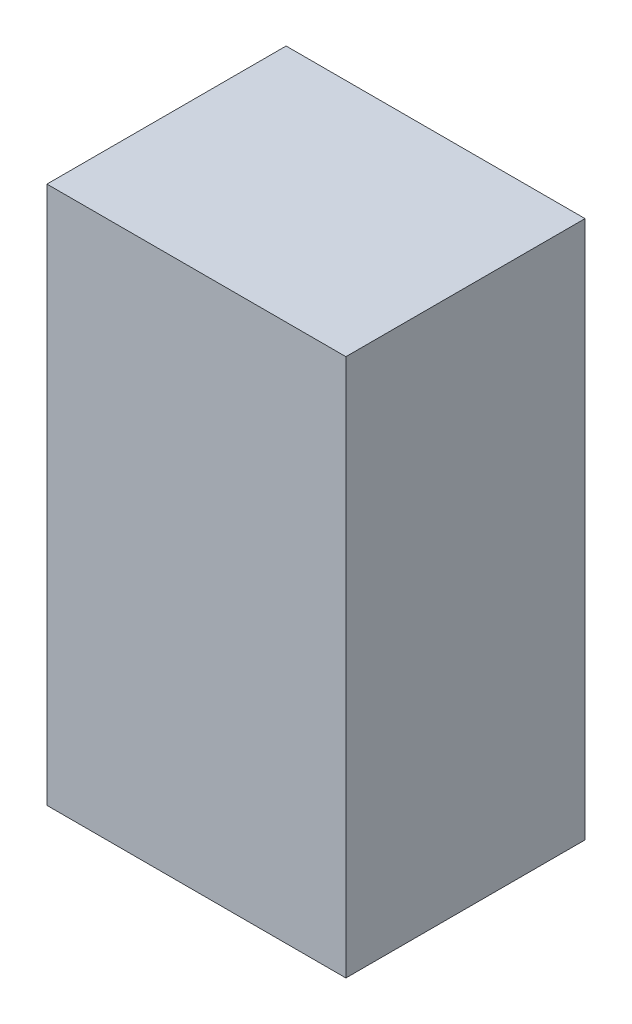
ISO-10303-21;
HEADER;
FILE_DESCRIPTION(('STEP AP214'),'2;1');
FILE_NAME('part.step','',(''),(''),'','','');
FILE_SCHEMA(('AUTOMOTIVE_DESIGN { 1 0 10303 214 1 1 1 1 }'));
ENDSEC;
DATA;
#1=APPLICATION_CONTEXT('core data for automotive mechanical design processes');
#2=APPLICATION_PROTOCOL_DEFINITION('international standard','automotive_design',2000,#1);
#3=PRODUCT_CONTEXT('',#1,'mechanical');
#4=PRODUCT('Part','Part','',(#3));
#5=PRODUCT_RELATED_PRODUCT_CATEGORY('part','',(#4));
#6=PRODUCT_DEFINITION_FORMATION('','',#4);
#7=PRODUCT_DEFINITION_CONTEXT('part definition',#1,'design');
#8=PRODUCT_DEFINITION('design','',#6,#7);
#9=PRODUCT_DEFINITION_SHAPE('','',#8);
#10=(LENGTH_UNIT() NAMED_UNIT(*) SI_UNIT(.MILLI.,.METRE.));
#11=(NAMED_UNIT(*) PLANE_ANGLE_UNIT() SI_UNIT($,.RADIAN.));
#12=(NAMED_UNIT(*) SI_UNIT($,.STERADIAN.) SOLID_ANGLE_UNIT());
#13=UNCERTAINTY_MEASURE_WITH_UNIT(LENGTH_MEASURE(1.E-05),#10,'distance_accuracy_value','');
#14=(GEOMETRIC_REPRESENTATION_CONTEXT(3) GLOBAL_UNCERTAINTY_ASSIGNED_CONTEXT((#13)) GLOBAL_UNIT_ASSIGNED_CONTEXT((#10,
#11,#12)) REPRESENTATION_CONTEXT('',''));
#15=CARTESIAN_POINT('',(0.,0.,0.));
#16=DIRECTION('',(0.,0.,1.));
#17=DIRECTION('',(1.,0.,0.));
#18=AXIS2_PLACEMENT_3D('',#15,#16,#17);
#19=CARTESIAN_POINT('',(0.,0.,20.));
#20=DIRECTION('',(1.,0.,0.));
#21=DIRECTION('',(0.,1.,0.));
#22=AXIS2_PLACEMENT_3D('',#19,#20,#21);
#23=PLANE('',#22);
#24=DIRECTION('',(0.,-1.,0.));
#25=VECTOR('',#24,1.);
#26=CARTESIAN_POINT('',(0.,0.,0.));
#27=LINE('',#26,#25);
#28=CARTESIAN_POINT('',(0.,0.,0.));
#29=VERTEX_POINT('',#28);
#30=CARTESIAN_POINT('',(0.,-45.,0.));
#31=VERTEX_POINT('',#30);
#32=EDGE_CURVE('E93',#29,#31,#27,.T.);
#33=ORIENTED_EDGE('',*,*,#32,.T.);
#34=DIRECTION('',(0.,0.,-1.));
#35=VECTOR('',#34,1.);
#36=CARTESIAN_POINT('',(0.,-45.,20.));
#37=LINE('',#36,#35);
#38=CARTESIAN_POINT('',(0.,-45.,20.));
#39=VERTEX_POINT('',#38);
#40=EDGE_CURVE('E11',#39,#31,#37,.T.);
#41=ORIENTED_EDGE('',*,*,#40,.F.);
#42=DIRECTION('',(0.,-1.,0.));
#43=VECTOR('',#42,1.);
#44=CARTESIAN_POINT('',(0.,0.,20.));
#45=LINE('',#44,#43);
#46=CARTESIAN_POINT('',(0.,0.,20.));
#47=VERTEX_POINT('',#46);
#48=EDGE_CURVE('E81',#47,#39,#45,.T.);
#49=ORIENTED_EDGE('',*,*,#48,.F.);
#50=DIRECTION('',(0.,0.,-1.));
#51=VECTOR('',#50,1.);
#52=CARTESIAN_POINT('',(0.,0.,20.));
#53=LINE('',#52,#51);
#54=EDGE_CURVE('E89',#47,#29,#53,.T.);
#55=ORIENTED_EDGE('',*,*,#54,.T.);
#56=EDGE_LOOP('',(#33,#41,#49,#55));
#57=FACE_BOUND('',#56,.T.);
#58=ADVANCED_FACE('F30',(#57),#23,.F.);
#59=CARTESIAN_POINT('',(0.,-45.,20.));
#60=DIRECTION('',(0.,1.,0.));
#61=DIRECTION('',(0.,0.,1.));
#62=AXIS2_PLACEMENT_3D('',#59,#60,#61);
#63=PLANE('',#62);
#64=DIRECTION('',(1.,0.,0.));
#65=VECTOR('',#64,1.);
#66=CARTESIAN_POINT('',(0.,-45.,0.));
#67=LINE('',#66,#65);
#68=CARTESIAN_POINT('',(25.,-45.,0.));
#69=VERTEX_POINT('',#68);
#70=EDGE_CURVE('E85',#31,#69,#67,.T.);
#71=ORIENTED_EDGE('',*,*,#70,.T.);
#72=DIRECTION('',(0.,0.,-1.));
#73=VECTOR('',#72,1.);
#74=CARTESIAN_POINT('',(25.,-45.,20.));
#75=LINE('',#74,#73);
#76=CARTESIAN_POINT('',(25.,-45.,20.));
#77=VERTEX_POINT('',#76);
#78=EDGE_CURVE('E38',#77,#69,#75,.T.);
#79=ORIENTED_EDGE('',*,*,#78,.F.);
#80=DIRECTION('',(1.,0.,0.));
#81=VECTOR('',#80,1.);
#82=CARTESIAN_POINT('',(0.,-45.,20.));
#83=LINE('',#82,#81);
#84=EDGE_CURVE('E76',#39,#77,#83,.T.);
#85=ORIENTED_EDGE('',*,*,#84,.F.);
#86=ORIENTED_EDGE('',*,*,#40,.T.);
#87=EDGE_LOOP('',(#71,#79,#85,#86));
#88=FACE_BOUND('',#87,.T.);
#89=ADVANCED_FACE('F84',(#88),#63,.F.);
#90=CARTESIAN_POINT('',(25.,0.,20.));
#91=DIRECTION('',(-1.,0.,0.));
#92=DIRECTION('',(0.,-1.,0.));
#93=AXIS2_PLACEMENT_3D('',#90,#91,#92);
#94=PLANE('',#93);
#95=DIRECTION('',(0.,1.,0.));
#96=VECTOR('',#95,1.);
#97=CARTESIAN_POINT('',(25.,0.,0.));
#98=LINE('',#97,#96);
#99=CARTESIAN_POINT('',(25.,0.,0.));
#100=VERTEX_POINT('',#99);
#101=EDGE_CURVE('E63',#69,#100,#98,.T.);
#102=ORIENTED_EDGE('',*,*,#101,.T.);
#103=DIRECTION('',(0.,0.,-1.));
#104=VECTOR('',#103,1.);
#105=CARTESIAN_POINT('',(25.,0.,20.));
#106=LINE('',#105,#104);
#107=CARTESIAN_POINT('',(25.,0.,20.));
#108=VERTEX_POINT('',#107);
#109=EDGE_CURVE('E86',#108,#100,#106,.T.);
#110=ORIENTED_EDGE('',*,*,#109,.F.);
#111=DIRECTION('',(0.,1.,0.));
#112=VECTOR('',#111,1.);
#113=CARTESIAN_POINT('',(25.,0.,20.));
#114=LINE('',#113,#112);
#115=EDGE_CURVE('E79',#77,#108,#114,.T.);
#116=ORIENTED_EDGE('',*,*,#115,.F.);
#117=ORIENTED_EDGE('',*,*,#78,.T.);
#118=EDGE_LOOP('',(#102,#110,#116,#117));
#119=FACE_BOUND('',#118,.T.);
#120=ADVANCED_FACE('F87',(#119),#94,.F.);
#121=CARTESIAN_POINT('',(0.,0.,20.));
#122=DIRECTION('',(0.,-1.,0.));
#123=DIRECTION('',(0.,0.,-1.));
#124=AXIS2_PLACEMENT_3D('',#121,#122,#123);
#125=PLANE('',#124);
#126=DIRECTION('',(-1.,0.,0.));
#127=VECTOR('',#126,1.);
#128=CARTESIAN_POINT('',(0.,0.,0.));
#129=LINE('',#128,#127);
#130=EDGE_CURVE('E69',#100,#29,#129,.T.);
#131=ORIENTED_EDGE('',*,*,#130,.T.);
#132=ORIENTED_EDGE('',*,*,#54,.F.);
#133=DIRECTION('',(-1.,0.,0.));
#134=VECTOR('',#133,1.);
#135=CARTESIAN_POINT('',(0.,0.,20.));
#136=LINE('',#135,#134);
#137=EDGE_CURVE('E46',#108,#47,#136,.T.);
#138=ORIENTED_EDGE('',*,*,#137,.F.);
#139=ORIENTED_EDGE('',*,*,#109,.T.);
#140=EDGE_LOOP('',(#131,#132,#138,#139));
#141=FACE_BOUND('',#140,.T.);
#142=ADVANCED_FACE('F100',(#141),#125,.F.);
#143=CARTESIAN_POINT('',(0.,-45.,20.));
#144=DIRECTION('',(0.,0.,1.));
#145=DIRECTION('',(1.,0.,0.));
#146=AXIS2_PLACEMENT_3D('',#143,#144,#145);
#147=PLANE('',#146);
#148=ORIENTED_EDGE('',*,*,#48,.T.);
#149=ORIENTED_EDGE('',*,*,#84,.T.);
#150=ORIENTED_EDGE('',*,*,#115,.T.);
#151=ORIENTED_EDGE('',*,*,#137,.T.);
#152=EDGE_LOOP('',(#148,#149,#150,#151));
#153=FACE_BOUND('',#152,.T.);
#154=ADVANCED_FACE('F77',(#153),#147,.T.);
#155=CARTESIAN_POINT('',(0.,-45.,0.));
#156=DIRECTION('',(0.,0.,1.));
#157=DIRECTION('',(1.,0.,0.));
#158=AXIS2_PLACEMENT_3D('',#155,#156,#157);
#159=PLANE('',#158);
#160=ORIENTED_EDGE('',*,*,#32,.F.);
#161=ORIENTED_EDGE('',*,*,#130,.F.);
#162=ORIENTED_EDGE('',*,*,#101,.F.);
#163=ORIENTED_EDGE('',*,*,#70,.F.);
#164=EDGE_LOOP('',(#160,#161,#162,#163));
#165=FACE_BOUND('',#164,.T.);
#166=ADVANCED_FACE('F103',(#165),#159,.F.);
#167=CLOSED_SHELL('',(#58,#89,#120,#142,#154,#166));
#168=MANIFOLD_SOLID_BREP('B2',#167);
#169=ADVANCED_BREP_SHAPE_REPRESENTATION('',(#18,#168),#14);
#170=SHAPE_DEFINITION_REPRESENTATION(#9,#169);
ENDSEC;
END-ISO-10303-21;
